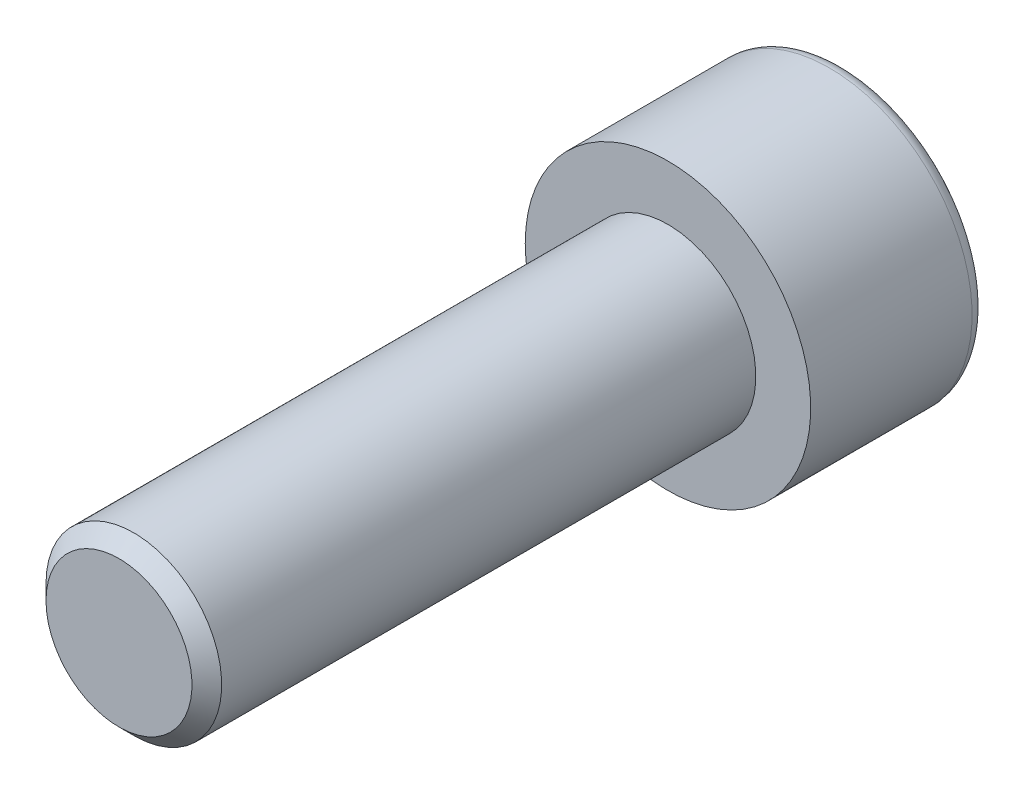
ISO-10303-21;
HEADER;
FILE_DESCRIPTION(('STEP AP214'),'2;1');
FILE_NAME('part.step','',(''),(''),'','','');
FILE_SCHEMA(('AUTOMOTIVE_DESIGN { 1 0 10303 214 1 1 1 1 }'));
ENDSEC;
DATA;
#1=APPLICATION_CONTEXT('core data for automotive mechanical design processes');
#2=APPLICATION_PROTOCOL_DEFINITION('international standard','automotive_design',2000,#1);
#3=PRODUCT_CONTEXT('',#1,'mechanical');
#4=PRODUCT('Part','Part','',(#3));
#5=PRODUCT_RELATED_PRODUCT_CATEGORY('part','',(#4));
#6=PRODUCT_DEFINITION_FORMATION('','',#4);
#7=PRODUCT_DEFINITION_CONTEXT('part definition',#1,'design');
#8=PRODUCT_DEFINITION('design','',#6,#7);
#9=PRODUCT_DEFINITION_SHAPE('','',#8);
#10=(LENGTH_UNIT() NAMED_UNIT(*) SI_UNIT(.MILLI.,.METRE.));
#11=(NAMED_UNIT(*) PLANE_ANGLE_UNIT() SI_UNIT($,.RADIAN.));
#12=(NAMED_UNIT(*) SI_UNIT($,.STERADIAN.) SOLID_ANGLE_UNIT());
#13=UNCERTAINTY_MEASURE_WITH_UNIT(LENGTH_MEASURE(1.E-05),#10,'distance_accuracy_value','');
#14=(GEOMETRIC_REPRESENTATION_CONTEXT(3) GLOBAL_UNCERTAINTY_ASSIGNED_CONTEXT((#13)) GLOBAL_UNIT_ASSIGNED_CONTEXT((#10,
#11,#12)) REPRESENTATION_CONTEXT('',''));
#15=CARTESIAN_POINT('',(0.,0.,0.));
#16=DIRECTION('',(0.,0.,1.));
#17=DIRECTION('',(1.,0.,0.));
#18=AXIS2_PLACEMENT_3D('',#15,#16,#17);
#19=CARTESIAN_POINT('',(0.,5.85,-8.));
#20=DIRECTION('',(0.,0.,1.));
#21=DIRECTION('',(1.,0.,0.));
#22=AXIS2_PLACEMENT_3D('',#19,#20,#21);
#23=PLANE('',#22);
#24=CARTESIAN_POINT('',(0.,0.,-8.));
#25=DIRECTION('',(0.,0.,-1.));
#26=DIRECTION('',(-1.,0.,0.));
#27=AXIS2_PLACEMENT_3D('',#24,#25,#26);
#28=CIRCLE('',#27,5.85);
#29=CARTESIAN_POINT('',(-5.85,0.,-8.));
#30=VERTEX_POINT('',#29);
#31=EDGE_CURVE('E106',#30,#30,#28,.T.);
#32=ORIENTED_EDGE('',*,*,#31,.T.);
#33=EDGE_LOOP('',(#32));
#34=FACE_BOUND('',#33,.T.);
#35=DIRECTION('',(-0.5,-0.866025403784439,0.));
#36=VECTOR('',#35,1.);
#37=CARTESIAN_POINT('',(-1.73205,2.99999860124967,-8.));
#38=LINE('',#37,#36);
#39=CARTESIAN_POINT('',(-1.73205,2.99999860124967,-8.));
#40=VERTEX_POINT('',#39);
#41=CARTESIAN_POINT('',(-3.4641,0.,-8.));
#42=VERTEX_POINT('',#41);
#43=EDGE_CURVE('E30',#40,#42,#38,.T.);
#44=ORIENTED_EDGE('',*,*,#43,.T.);
#45=DIRECTION('',(0.5,-0.866025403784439,0.));
#46=VECTOR('',#45,1.);
#47=CARTESIAN_POINT('',(-3.4641,0.,-8.));
#48=LINE('',#47,#46);
#49=CARTESIAN_POINT('',(-1.73205,-2.99999860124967,-8.));
#50=VERTEX_POINT('',#49);
#51=EDGE_CURVE('E166',#42,#50,#48,.T.);
#52=ORIENTED_EDGE('',*,*,#51,.T.);
#53=DIRECTION('',(1.,0.,0.));
#54=VECTOR('',#53,1.);
#55=CARTESIAN_POINT('',(-1.73205,-2.99999860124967,-8.));
#56=LINE('',#55,#54);
#57=CARTESIAN_POINT('',(1.73205,-2.99999860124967,-8.));
#58=VERTEX_POINT('',#57);
#59=EDGE_CURVE('E217',#50,#58,#56,.T.);
#60=ORIENTED_EDGE('',*,*,#59,.T.);
#61=DIRECTION('',(0.5,0.866025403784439,0.));
#62=VECTOR('',#61,1.);
#63=CARTESIAN_POINT('',(1.73205,-2.99999860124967,-8.));
#64=LINE('',#63,#62);
#65=CARTESIAN_POINT('',(3.4641,0.,-8.));
#66=VERTEX_POINT('',#65);
#67=EDGE_CURVE('E215',#58,#66,#64,.T.);
#68=ORIENTED_EDGE('',*,*,#67,.T.);
#69=DIRECTION('',(-0.5,0.866025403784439,0.));
#70=VECTOR('',#69,1.);
#71=CARTESIAN_POINT('',(3.4641,0.,-8.));
#72=LINE('',#71,#70);
#73=CARTESIAN_POINT('',(1.73205,2.99999860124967,-8.));
#74=VERTEX_POINT('',#73);
#75=EDGE_CURVE('E95',#66,#74,#72,.T.);
#76=ORIENTED_EDGE('',*,*,#75,.T.);
#77=DIRECTION('',(-1.,0.,0.));
#78=VECTOR('',#77,1.);
#79=CARTESIAN_POINT('',(1.73205,2.99999860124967,-8.));
#80=LINE('',#79,#78);
#81=EDGE_CURVE('E91',#74,#40,#80,.T.);
#82=ORIENTED_EDGE('',*,*,#81,.T.);
#83=EDGE_LOOP('',(#44,#52,#60,#68,#76,#82));
#84=FACE_BOUND('',#83,.T.);
#85=ADVANCED_FACE('F16',(#34,#84),#23,.F.);
#86=CARTESIAN_POINT('',(0.,0.,25.));
#87=DIRECTION('',(0.,0.,-1.));
#88=DIRECTION('',(-1.,0.,0.));
#89=AXIS2_PLACEMENT_3D('',#86,#87,#88);
#90=PLANE('',#89);
#91=CARTESIAN_POINT('',(0.,0.,25.));
#92=DIRECTION('',(0.,0.,-1.));
#93=DIRECTION('',(-1.,0.,0.));
#94=AXIS2_PLACEMENT_3D('',#91,#92,#93);
#95=CIRCLE('',#94,3.3234375);
#96=CARTESIAN_POINT('',(-3.32343750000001,0.,25.));
#97=VERTEX_POINT('',#96);
#98=EDGE_CURVE('E10',#97,#97,#95,.T.);
#99=ORIENTED_EDGE('',*,*,#98,.F.);
#100=EDGE_LOOP('',(#99));
#101=FACE_BOUND('',#100,.T.);
#102=ADVANCED_FACE('F125',(#101),#90,.F.);
#103=CARTESIAN_POINT('',(0.,0.,25.));
#104=DIRECTION('',(0.,0.,-1.));
#105=DIRECTION('',(-1.,0.,0.));
#106=AXIS2_PLACEMENT_3D('',#103,#104,#105);
#107=CONICAL_SURFACE('',#106,3.3234375,0.785398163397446);
#108=CARTESIAN_POINT('',(0.,0.,24.3234375));
#109=DIRECTION('',(0.,0.,-1.));
#110=DIRECTION('',(-1.,0.,0.));
#111=AXIS2_PLACEMENT_3D('',#108,#109,#110);
#112=CIRCLE('',#111,4.);
#113=CARTESIAN_POINT('',(-4.00000000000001,0.,24.3234375));
#114=VERTEX_POINT('',#113);
#115=EDGE_CURVE('E23',#114,#114,#112,.T.);
#116=ORIENTED_EDGE('',*,*,#115,.F.);
#117=EDGE_LOOP('',(#116));
#118=FACE_BOUND('',#117,.T.);
#119=ORIENTED_EDGE('',*,*,#98,.T.);
#120=EDGE_LOOP('',(#119));
#121=FACE_BOUND('',#120,.T.);
#122=ADVANCED_FACE('F122',(#118,#121),#107,.T.);
#123=CARTESIAN_POINT('',(0.,0.,-8.));
#124=DIRECTION('',(0.,0.,-1.));
#125=DIRECTION('',(-1.,0.,0.));
#126=AXIS2_PLACEMENT_3D('',#123,#124,#125);
#127=CYLINDRICAL_SURFACE('',#126,4.);
#128=CARTESIAN_POINT('',(0.,0.,0.));
#129=DIRECTION('',(0.,0.,-1.));
#130=DIRECTION('',(-1.,0.,0.));
#131=AXIS2_PLACEMENT_3D('',#128,#129,#130);
#132=CIRCLE('',#131,4.);
#133=CARTESIAN_POINT('',(-4.,0.,0.));
#134=VERTEX_POINT('',#133);
#135=EDGE_CURVE('E115',#134,#134,#132,.T.);
#136=ORIENTED_EDGE('',*,*,#135,.F.);
#137=EDGE_LOOP('',(#136));
#138=FACE_BOUND('',#137,.T.);
#139=ORIENTED_EDGE('',*,*,#115,.T.);
#140=EDGE_LOOP('',(#139));
#141=FACE_BOUND('',#140,.T.);
#142=ADVANCED_FACE('F120',(#138,#141),#127,.T.);
#143=CARTESIAN_POINT('',(0.,4.,0.));
#144=DIRECTION('',(0.,0.,-1.));
#145=DIRECTION('',(-1.,0.,0.));
#146=AXIS2_PLACEMENT_3D('',#143,#144,#145);
#147=PLANE('',#146);
#148=CARTESIAN_POINT('',(0.,0.,0.));
#149=DIRECTION('',(0.,0.,-1.));
#150=DIRECTION('',(-1.,0.,0.));
#151=AXIS2_PLACEMENT_3D('',#148,#149,#150);
#152=CIRCLE('',#151,6.5);
#153=CARTESIAN_POINT('',(-6.5,0.,0.));
#154=VERTEX_POINT('',#153);
#155=EDGE_CURVE('E112',#154,#154,#152,.T.);
#156=ORIENTED_EDGE('',*,*,#155,.F.);
#157=EDGE_LOOP('',(#156));
#158=FACE_BOUND('',#157,.T.);
#159=ORIENTED_EDGE('',*,*,#135,.T.);
#160=EDGE_LOOP('',(#159));
#161=FACE_BOUND('',#160,.T.);
#162=ADVANCED_FACE('F138',(#158,#161),#147,.F.);
#163=CARTESIAN_POINT('',(0.,0.,-8.));
#164=DIRECTION('',(0.,0.,-1.));
#165=DIRECTION('',(-1.,0.,0.));
#166=AXIS2_PLACEMENT_3D('',#163,#164,#165);
#167=CYLINDRICAL_SURFACE('',#166,6.5);
#168=CARTESIAN_POINT('',(0.,0.,-7.35));
#169=DIRECTION('',(0.,0.,-1.));
#170=DIRECTION('',(-1.,0.,0.));
#171=AXIS2_PLACEMENT_3D('',#168,#169,#170);
#172=CIRCLE('',#171,6.5);
#173=CARTESIAN_POINT('',(-6.5,0.,-7.35));
#174=VERTEX_POINT('',#173);
#175=EDGE_CURVE('E109',#174,#174,#172,.T.);
#176=ORIENTED_EDGE('',*,*,#175,.F.);
#177=EDGE_LOOP('',(#176));
#178=FACE_BOUND('',#177,.T.);
#179=ORIENTED_EDGE('',*,*,#155,.T.);
#180=EDGE_LOOP('',(#179));
#181=FACE_BOUND('',#180,.T.);
#182=ADVANCED_FACE('F142',(#178,#181),#167,.T.);
#183=CARTESIAN_POINT('',(0.,0.,-7.35));
#184=DIRECTION('',(0.,0.,-1.));
#185=DIRECTION('',(-1.,0.,0.));
#186=AXIS2_PLACEMENT_3D('',#183,#184,#185);
#187=TOROIDAL_SURFACE('',#186,5.85,0.65);
#188=ORIENTED_EDGE('',*,*,#31,.F.);
#189=EDGE_LOOP('',(#188));
#190=FACE_BOUND('',#189,.T.);
#191=ORIENTED_EDGE('',*,*,#175,.T.);
#192=EDGE_LOOP('',(#191));
#193=FACE_BOUND('',#192,.T.);
#194=ADVANCED_FACE('F146',(#190,#193),#187,.T.);
#195=CARTESIAN_POINT('',(-1.73205,2.99999860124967,-2.00000093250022));
#196=DIRECTION('',(0.866025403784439,-0.5,0.));
#197=DIRECTION('',(0.5,0.866025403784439,0.));
#198=AXIS2_PLACEMENT_3D('',#195,#196,#197);
#199=PLANE('',#198);
#200=DIRECTION('',(0.,0.,-1.));
#201=VECTOR('',#200,1.);
#202=CARTESIAN_POINT('',(-3.4641,0.,-2.00000093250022));
#203=LINE('',#202,#201);
#204=CARTESIAN_POINT('',(-3.4641,0.,-4.));
#205=VERTEX_POINT('',#204);
#206=EDGE_CURVE('E104',#205,#42,#203,.T.);
#207=ORIENTED_EDGE('',*,*,#206,.T.);
#208=ORIENTED_EDGE('',*,*,#43,.F.);
#209=DIRECTION('',(0.,0.,-1.));
#210=VECTOR('',#209,1.);
#211=CARTESIAN_POINT('',(-1.73205,2.99999860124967,-2.00000093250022));
#212=LINE('',#211,#210);
#213=CARTESIAN_POINT('',(-1.73205,2.99999860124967,-4.));
#214=VERTEX_POINT('',#213);
#215=EDGE_CURVE('E85',#214,#40,#212,.T.);
#216=ORIENTED_EDGE('',*,*,#215,.F.);
#217=CARTESIAN_POINT('',(-3.46410011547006,-2.E-07,-4.00000006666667));
#218=CARTESIAN_POINT('',(-3.38798700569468,0.131831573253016,-3.95604339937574));
#219=CARTESIAN_POINT('',(-3.31121688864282,0.264801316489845,-3.91606711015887));
#220=CARTESIAN_POINT('',(-3.15634743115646,0.533043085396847,-3.84628969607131));
#221=CARTESIAN_POINT('',(-3.07824533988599,0.668319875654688,-3.81651325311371));
#222=CARTESIAN_POINT('',(-2.92300903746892,0.937197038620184,-3.77016407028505));
#223=CARTESIAN_POINT('',(-2.84589870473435,1.070756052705,-3.75328281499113));
#224=CARTESIAN_POINT('',(-2.69131539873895,1.33850219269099,-3.73313388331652));
#225=CARTESIAN_POINT('',(-2.61384298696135,1.4726883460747,-3.72984951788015));
#226=CARTESIAN_POINT('',(-2.46909408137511,1.72340080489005,-3.7366995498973));
#227=CARTESIAN_POINT('',(-2.40179586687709,1.8399647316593,-3.74515203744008));
#228=CARTESIAN_POINT('',(-2.26763786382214,2.07233320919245,-3.77193605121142));
#229=CARTESIAN_POINT('',(-2.20077853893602,2.18813695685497,-3.79027671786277));
#230=CARTESIAN_POINT('',(-2.06634415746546,2.42098413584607,-3.83612483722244));
#231=CARTESIAN_POINT('',(-1.99878610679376,2.53799811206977,-3.86382654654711));
#232=CARTESIAN_POINT('',(-1.86467734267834,2.77028130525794,-3.92669771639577));
#233=CARTESIAN_POINT('',(-1.79812491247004,2.88555349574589,-3.96185241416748));
#234=CARTESIAN_POINT('',(-1.73204988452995,2.99999880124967,-4.00000006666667));
#235=B_SPLINE_CURVE_WITH_KNOTS('',3,(#217,#218,#219,#220,#221,#222,#223,#224,#225,#226,#227,
#228,#229,#230,#231,#232,#233,#234),.UNSPECIFIED.,.F.,.F.,(4,2,2,2,2,2,2,2,4),(0.,
0.475523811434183,0.952190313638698,1.4170607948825,1.8813605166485,2.2855607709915,
2.69013530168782,3.10368135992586,3.51641580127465),.UNSPECIFIED.);
#236=EDGE_CURVE('E78',#205,#214,#235,.T.);
#237=ORIENTED_EDGE('',*,*,#236,.F.);
#238=EDGE_LOOP('',(#207,#208,#216,#237));
#239=FACE_BOUND('',#238,.T.);
#240=ADVANCED_FACE('F86',(#239),#199,.T.);
#241=CARTESIAN_POINT('',(-3.4641,0.,-2.00000093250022));
#242=DIRECTION('',(0.866025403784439,0.5,0.));
#243=DIRECTION('',(-0.5,0.866025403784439,0.));
#244=AXIS2_PLACEMENT_3D('',#241,#242,#243);
#245=PLANE('',#244);
#246=DIRECTION('',(0.,0.,-1.));
#247=VECTOR('',#246,1.);
#248=CARTESIAN_POINT('',(-1.73205,-2.99999860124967,-2.00000093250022));
#249=LINE('',#248,#247);
#250=CARTESIAN_POINT('',(-1.73205,-2.99999860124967,-4.));
#251=VERTEX_POINT('',#250);
#252=EDGE_CURVE('E102',#251,#50,#249,.T.);
#253=ORIENTED_EDGE('',*,*,#252,.T.);
#254=ORIENTED_EDGE('',*,*,#51,.F.);
#255=ORIENTED_EDGE('',*,*,#206,.F.);
#256=CARTESIAN_POINT('',(-1.73204988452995,-2.99999880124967,-4.00000006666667));
#257=CARTESIAN_POINT('',(-1.80816299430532,-2.86816702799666,-3.95604339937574));
#258=CARTESIAN_POINT('',(-1.88493311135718,-2.73519728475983,-3.91606711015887));
#259=CARTESIAN_POINT('',(-2.03980256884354,-2.46695551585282,-3.84628969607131));
#260=CARTESIAN_POINT('',(-2.11790466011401,-2.33167872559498,-3.81651325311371));
#261=CARTESIAN_POINT('',(-2.27314096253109,-2.06280156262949,-3.77016407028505));
#262=CARTESIAN_POINT('',(-2.35025129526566,-1.92924254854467,-3.75328281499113));
#263=CARTESIAN_POINT('',(-2.50483460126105,-1.66149640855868,-3.73313388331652));
#264=CARTESIAN_POINT('',(-2.58230701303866,-1.52731025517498,-3.72984951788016));
#265=CARTESIAN_POINT('',(-2.72705591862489,-1.27659779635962,-3.73669954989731));
#266=CARTESIAN_POINT('',(-2.79435413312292,-1.16003386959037,-3.74515203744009));
#267=CARTESIAN_POINT('',(-2.92851213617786,-0.927665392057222,-3.77193605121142));
#268=CARTESIAN_POINT('',(-2.99537146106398,-0.811861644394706,-3.79027671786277));
#269=CARTESIAN_POINT('',(-3.12980584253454,-0.579014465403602,-3.83612483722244));
#270=CARTESIAN_POINT('',(-3.19736389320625,-0.4620004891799,-3.86382654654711));
#271=CARTESIAN_POINT('',(-3.33147265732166,-0.229717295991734,-3.92669771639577));
#272=CARTESIAN_POINT('',(-3.39802508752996,-0.114445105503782,-3.96185241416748));
#273=CARTESIAN_POINT('',(-3.46410011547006,2.00000000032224E-07,-4.00000006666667));
#274=B_SPLINE_CURVE_WITH_KNOTS('',3,(#256,#257,#258,#259,#260,#261,#262,#263,#264,#265,#266,
#267,#268,#269,#270,#271,#272,#273),.UNSPECIFIED.,.F.,.F.,(4,2,2,2,2,2,2,2,4),(0.,
0.475523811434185,0.9521903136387,1.4170607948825,1.8813605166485,2.28556077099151,
2.69013530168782,3.10368135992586,3.51641580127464),.UNSPECIFIED.);
#275=EDGE_CURVE('E82',#251,#205,#274,.T.);
#276=ORIENTED_EDGE('',*,*,#275,.F.);
#277=EDGE_LOOP('',(#253,#254,#255,#276));
#278=FACE_BOUND('',#277,.T.);
#279=ADVANCED_FACE('F154',(#278),#245,.T.);
#280=CARTESIAN_POINT('',(-1.73205,-2.99999860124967,-2.00000093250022));
#281=DIRECTION('',(0.,1.,0.));
#282=DIRECTION('',(-1.,0.,0.));
#283=AXIS2_PLACEMENT_3D('',#280,#281,#282);
#284=PLANE('',#283);
#285=DIRECTION('',(0.,0.,-1.));
#286=VECTOR('',#285,1.);
#287=CARTESIAN_POINT('',(1.73205,-2.99999860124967,-2.00000093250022));
#288=LINE('',#287,#286);
#289=CARTESIAN_POINT('',(1.73205,-2.99999860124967,-4.));
#290=VERTEX_POINT('',#289);
#291=EDGE_CURVE('E100',#290,#58,#288,.T.);
#292=ORIENTED_EDGE('',*,*,#291,.T.);
#293=ORIENTED_EDGE('',*,*,#59,.F.);
#294=ORIENTED_EDGE('',*,*,#252,.F.);
#295=CARTESIAN_POINT('',(4.48543327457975,-2.99999860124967,-5.11550534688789));
#296=CARTESIAN_POINT('',(4.35588300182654,-2.99999860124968,-5.05335202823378));
#297=CARTESIAN_POINT('',(4.22601712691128,-2.99999860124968,-4.99184428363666));
#298=CARTESIAN_POINT('',(3.96548596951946,-2.99999860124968,-4.87048616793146));
#299=CARTESIAN_POINT('',(3.83482054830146,-2.99999860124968,-4.81063609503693));
#300=CARTESIAN_POINT('',(3.57177288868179,-2.99999860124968,-4.69262519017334));
#301=CARTESIAN_POINT('',(3.43938504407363,-2.99999860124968,-4.63447680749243));
#302=CARTESIAN_POINT('',(3.17349843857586,-2.99999860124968,-4.52078755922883));
#303=CARTESIAN_POINT('',(3.03999973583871,-2.99999860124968,-4.46524655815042));
#304=CARTESIAN_POINT('',(2.76816246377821,-2.99999860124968,-4.35605208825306));
#305=CARTESIAN_POINT('',(2.62978861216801,-2.99999860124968,-4.30248593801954));
#306=CARTESIAN_POINT('',(2.35136718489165,-2.99999860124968,-4.19980717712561));
#307=CARTESIAN_POINT('',(2.21131941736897,-2.99999860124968,-4.15069508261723));
#308=CARTESIAN_POINT('',(1.92964461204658,-2.99999860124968,-4.05832683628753));
#309=CARTESIAN_POINT('',(1.78802198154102,-2.99999860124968,-4.01505738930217));
#310=CARTESIAN_POINT('',(1.50275951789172,-2.99999860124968,-3.93586037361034));
#311=CARTESIAN_POINT('',(1.35912038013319,-2.99999860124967,-3.89993033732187));
#312=CARTESIAN_POINT('',(1.07010555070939,-2.99999860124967,-3.83732117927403));
#313=CARTESIAN_POINT('',(0.92473396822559,-2.99999860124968,-3.81062345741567));
#314=CARTESIAN_POINT('',(0.6323644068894,-2.99999860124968,-3.76822932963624));
#315=CARTESIAN_POINT('',(0.485366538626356,-2.99999860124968,-3.75253218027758));
#316=CARTESIAN_POINT('',(0.192319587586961,-2.99999860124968,-3.73359558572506));
#317=CARTESIAN_POINT('',(0.0462802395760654,-2.99999860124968,-3.73020913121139));
#318=CARTESIAN_POINT('',(-0.245570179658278,-2.99999860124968,-3.73580306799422));
#319=CARTESIAN_POINT('',(-0.391381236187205,-2.99999860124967,-3.74478422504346));
#320=CARTESIAN_POINT('',(-0.643868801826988,-2.99999860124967,-3.77043931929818));
#321=CARTESIAN_POINT('',(-0.750824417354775,-2.99999860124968,-3.78449289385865));
#322=CARTESIAN_POINT('',(-0.963839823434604,-2.99999860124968,-3.81828752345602));
#323=CARTESIAN_POINT('',(-1.06989946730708,-2.99999860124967,-3.83802949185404));
#324=CARTESIAN_POINT('',(-1.38665231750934,-2.99999860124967,-3.90473774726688));
#325=CARTESIAN_POINT('',(-1.59578448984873,-2.99999860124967,-3.95917098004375));
#326=CARTESIAN_POINT('',(-1.90847464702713,-2.99999860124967,-4.05215904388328));
#327=CARTESIAN_POINT('',(-2.01368123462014,-2.99999860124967,-4.0854738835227));
#328=CARTESIAN_POINT('',(-2.22307127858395,-2.99999860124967,-4.15520553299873));
#329=CARTESIAN_POINT('',(-2.32725472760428,-2.99999860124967,-4.19162236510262));
#330=CARTESIAN_POINT('',(-2.53464013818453,-2.99999860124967,-4.26700365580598));
#331=CARTESIAN_POINT('',(-2.63784247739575,-2.99999860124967,-4.305967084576));
#332=CARTESIAN_POINT('',(-2.84341531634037,-2.99999860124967,-4.38601920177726));
#333=CARTESIAN_POINT('',(-2.94578582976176,-2.99999860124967,-4.42710785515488));
#334=CARTESIAN_POINT('',(-3.20709883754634,-2.99999860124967,-4.53462485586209));
#335=CARTESIAN_POINT('',(-3.36551841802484,-2.99999860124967,-4.60232247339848));
#336=CARTESIAN_POINT('',(-3.6809303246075,-2.99999860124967,-4.74097445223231));
#337=CARTESIAN_POINT('',(-3.83792254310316,-2.99999860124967,-4.81192905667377));
#338=CARTESIAN_POINT('',(-4.15078500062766,-2.99999860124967,-4.95636009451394));
#339=CARTESIAN_POINT('',(-4.30665496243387,-2.99999860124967,-5.02983712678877));
#340=CARTESIAN_POINT('',(-4.61745612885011,-2.99999860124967,-5.17875355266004));
#341=CARTESIAN_POINT('',(-4.77238731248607,-2.99999860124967,-5.25419298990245));
#342=CARTESIAN_POINT('',(-5.23640411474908,-2.99999860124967,-5.48299925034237));
#343=CARTESIAN_POINT('',(-5.54434651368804,-2.99999860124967,-5.63868230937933));
#344=CARTESIAN_POINT('',(-6.15811760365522,-2.99999860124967,-5.95402730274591));
#345=CARTESIAN_POINT('',(-6.46394659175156,-2.99999860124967,-6.11368866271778));
#346=CARTESIAN_POINT('',(-7.04534859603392,-2.99999860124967,-6.42057513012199));
#347=CARTESIAN_POINT('',(-7.32105297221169,-2.99999860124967,-6.56755177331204));
#348=CARTESIAN_POINT('',(-7.87157644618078,-2.99999860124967,-6.86317920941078));
#349=CARTESIAN_POINT('',(-8.14639550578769,-2.99999860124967,-7.01183007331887));
#350=CARTESIAN_POINT('',(-8.69465217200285,-2.99999860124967,-7.31000711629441));
#351=CARTESIAN_POINT('',(-8.96809151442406,-2.99999860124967,-7.4595301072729));
#352=CARTESIAN_POINT('',(-9.51441589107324,-2.99999860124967,-7.7595484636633));
#353=CARTESIAN_POINT('',(-9.78730095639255,-2.99999860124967,-7.91004377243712));
#354=CARTESIAN_POINT('',(-10.0599874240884,-2.99999860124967,-8.06089576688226));
#355=B_SPLINE_CURVE_WITH_KNOTS('',3,(#295,#296,#297,#298,#299,#300,#301,#302,#303,#304,#305,
#306,#307,#308,#309,#310,#311,#312,#313,#314,#315,#316,#317,#318,#319,#320,#321,#322,#323,#324,
#325,#326,#327,#328,#329,#330,#331,#332,#333,#334,#335,#336,#337,#338,#339,#340,#341,#342,#343,
#344,#345,#346,#347,#348,#349,#350,#351,#352,#353,#354),.UNSPECIFIED.,.F.,.F.,(4,2,2,2,2,2,2,2,
2,2,2,2,2,2,2,2,2,2,2,2,2,2,2,2,2,2,2,2,2,4),(0.,0.431070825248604,0.862218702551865,
1.29598193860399,1.72972260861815,2.1748037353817,2.61993637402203,3.06403838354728,
3.50799083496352,3.95104358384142,4.39406638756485,4.83178108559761,5.26952288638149,
5.5929878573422,5.91650479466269,6.56394435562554,6.89498708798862,7.2260321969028,
7.55694425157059,7.88785084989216,8.40463217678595,8.92145214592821,9.43839567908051,
9.95535071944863,10.9904746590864,12.0254500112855,12.962744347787,13.9000785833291,
14.8350286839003,15.7699248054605),.UNSPECIFIED.);
#356=EDGE_CURVE('E191',#290,#251,#355,.T.);
#357=ORIENTED_EDGE('',*,*,#356,.F.);
#358=EDGE_LOOP('',(#292,#293,#294,#357));
#359=FACE_BOUND('',#358,.T.);
#360=ADVANCED_FACE('F195',(#359),#284,.T.);
#361=CARTESIAN_POINT('',(1.73205,-2.99999860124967,-2.00000093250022));
#362=DIRECTION('',(-0.866025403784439,0.5,0.));
#363=DIRECTION('',(-0.5,-0.866025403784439,0.));
#364=AXIS2_PLACEMENT_3D('',#361,#362,#363);
#365=PLANE('',#364);
#366=DIRECTION('',(0.,0.,-1.));
#367=VECTOR('',#366,1.);
#368=CARTESIAN_POINT('',(3.4641,0.,-2.00000093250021));
#369=LINE('',#368,#367);
#370=CARTESIAN_POINT('',(3.4641,0.,-4.));
#371=VERTEX_POINT('',#370);
#372=EDGE_CURVE('E93',#371,#66,#369,.T.);
#373=ORIENTED_EDGE('',*,*,#372,.T.);
#374=ORIENTED_EDGE('',*,*,#67,.F.);
#375=ORIENTED_EDGE('',*,*,#291,.F.);
#376=CARTESIAN_POINT('',(3.46410011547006,1.99999999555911E-07,-4.00000006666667));
#377=CARTESIAN_POINT('',(3.38798700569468,-0.131831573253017,-3.95604339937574));
#378=CARTESIAN_POINT('',(3.31121688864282,-0.264801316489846,-3.91606711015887));
#379=CARTESIAN_POINT('',(3.15634743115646,-0.533043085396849,-3.84628969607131));
#380=CARTESIAN_POINT('',(3.07824533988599,-0.668319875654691,-3.81651325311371));
#381=CARTESIAN_POINT('',(2.92300903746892,-0.937197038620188,-3.77016407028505));
#382=CARTESIAN_POINT('',(2.84589870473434,-1.07075605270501,-3.75328281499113));
#383=CARTESIAN_POINT('',(2.69131539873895,-1.338502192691,-3.73313388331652));
#384=CARTESIAN_POINT('',(2.61384298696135,-1.4726883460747,-3.72984951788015));
#385=CARTESIAN_POINT('',(2.46909408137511,-1.72340080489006,-3.7366995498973));
#386=CARTESIAN_POINT('',(2.40179586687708,-1.83996473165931,-3.74515203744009));
#387=CARTESIAN_POINT('',(2.26763786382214,-2.07233320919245,-3.77193605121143));
#388=CARTESIAN_POINT('',(2.20077853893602,-2.18813695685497,-3.79027671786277));
#389=CARTESIAN_POINT('',(2.06634415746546,-2.42098413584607,-3.83612483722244));
#390=CARTESIAN_POINT('',(1.99878610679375,-2.53799811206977,-3.86382654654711));
#391=CARTESIAN_POINT('',(1.86467734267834,-2.77028130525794,-3.92669771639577));
#392=CARTESIAN_POINT('',(1.79812491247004,-2.88555349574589,-3.96185241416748));
#393=CARTESIAN_POINT('',(1.73204988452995,-2.99999880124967,-4.00000006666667));
#394=B_SPLINE_CURVE_WITH_KNOTS('',3,(#376,#377,#378,#379,#380,#381,#382,#383,#384,#385,#386,
#387,#388,#389,#390,#391,#392,#393),.UNSPECIFIED.,.F.,.F.,(4,2,2,2,2,2,2,2,4),(0.,
0.475523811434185,0.952190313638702,1.4170607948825,1.8813605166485,2.28556077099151,
2.69013530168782,3.10368135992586,3.51641580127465),.UNSPECIFIED.);
#395=EDGE_CURVE('E186',#371,#290,#394,.T.);
#396=ORIENTED_EDGE('',*,*,#395,.F.);
#397=EDGE_LOOP('',(#373,#374,#375,#396));
#398=FACE_BOUND('',#397,.T.);
#399=ADVANCED_FACE('F198',(#398),#365,.T.);
#400=CARTESIAN_POINT('',(3.4641,0.,-2.00000093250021));
#401=DIRECTION('',(-0.866025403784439,-0.5,0.));
#402=DIRECTION('',(0.5,-0.866025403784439,0.));
#403=AXIS2_PLACEMENT_3D('',#400,#401,#402);
#404=PLANE('',#403);
#405=DIRECTION('',(0.,0.,-1.));
#406=VECTOR('',#405,1.);
#407=CARTESIAN_POINT('',(1.73205,2.99999860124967,-2.00000093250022));
#408=LINE('',#407,#406);
#409=CARTESIAN_POINT('',(1.73205,2.99999860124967,-4.));
#410=VERTEX_POINT('',#409);
#411=EDGE_CURVE('E90',#410,#74,#408,.T.);
#412=ORIENTED_EDGE('',*,*,#411,.T.);
#413=ORIENTED_EDGE('',*,*,#75,.F.);
#414=ORIENTED_EDGE('',*,*,#372,.F.);
#415=CARTESIAN_POINT('',(1.73204988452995,2.99999880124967,-4.00000006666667));
#416=CARTESIAN_POINT('',(1.80816299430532,2.86816702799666,-3.95604339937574));
#417=CARTESIAN_POINT('',(1.88493311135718,2.73519728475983,-3.91606711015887));
#418=CARTESIAN_POINT('',(2.03980256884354,2.46695551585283,-3.84628969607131));
#419=CARTESIAN_POINT('',(2.11790466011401,2.33167872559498,-3.81651325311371));
#420=CARTESIAN_POINT('',(2.27314096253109,2.06280156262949,-3.77016407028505));
#421=CARTESIAN_POINT('',(2.35025129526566,1.92924254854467,-3.75328281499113));
#422=CARTESIAN_POINT('',(2.50483460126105,1.66149640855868,-3.73313388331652));
#423=CARTESIAN_POINT('',(2.58230701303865,1.52731025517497,-3.72984951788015));
#424=CARTESIAN_POINT('',(2.72705591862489,1.27659779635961,-3.7366995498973));
#425=CARTESIAN_POINT('',(2.79435413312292,1.16003386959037,-3.74515203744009));
#426=CARTESIAN_POINT('',(2.92851213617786,0.927665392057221,-3.77193605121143));
#427=CARTESIAN_POINT('',(2.99537146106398,0.811861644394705,-3.79027671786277));
#428=CARTESIAN_POINT('',(3.12980584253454,0.579014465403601,-3.83612483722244));
#429=CARTESIAN_POINT('',(3.19736389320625,0.462000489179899,-3.86382654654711));
#430=CARTESIAN_POINT('',(3.33147265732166,0.229717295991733,-3.92669771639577));
#431=CARTESIAN_POINT('',(3.39802508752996,0.114445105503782,-3.96185241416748));
#432=CARTESIAN_POINT('',(3.46410011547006,-2.00000000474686E-07,-4.00000006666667));
#433=B_SPLINE_CURVE_WITH_KNOTS('',3,(#415,#416,#417,#418,#419,#420,#421,#422,#423,#424,#425,
#426,#427,#428,#429,#430,#431,#432),.UNSPECIFIED.,.F.,.F.,(4,2,2,2,2,2,2,2,4),(0.,
0.475523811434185,0.952190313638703,1.41706079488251,1.8813605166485,2.28556077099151,
2.69013530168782,3.10368135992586,3.51641580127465),.UNSPECIFIED.);
#434=EDGE_CURVE('E38',#410,#371,#433,.T.);
#435=ORIENTED_EDGE('',*,*,#434,.F.);
#436=EDGE_LOOP('',(#412,#413,#414,#435));
#437=FACE_BOUND('',#436,.T.);
#438=ADVANCED_FACE('F202',(#437),#404,.T.);
#439=CARTESIAN_POINT('',(1.73205,2.99999860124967,-2.00000093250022));
#440=DIRECTION('',(0.,-1.,0.));
#441=DIRECTION('',(1.,0.,0.));
#442=AXIS2_PLACEMENT_3D('',#439,#440,#441);
#443=PLANE('',#442);
#444=ORIENTED_EDGE('',*,*,#215,.T.);
#445=ORIENTED_EDGE('',*,*,#81,.F.);
#446=ORIENTED_EDGE('',*,*,#411,.F.);
#447=CARTESIAN_POINT('',(4.48543327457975,2.99999860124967,-5.11550534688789));
#448=CARTESIAN_POINT('',(4.35588300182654,2.99999860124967,-5.05335202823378));
#449=CARTESIAN_POINT('',(4.22601712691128,2.99999860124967,-4.99184428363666));
#450=CARTESIAN_POINT('',(3.96548596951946,2.99999860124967,-4.87048616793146));
#451=CARTESIAN_POINT('',(3.83482054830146,2.99999860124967,-4.81063609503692));
#452=CARTESIAN_POINT('',(3.57177288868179,2.99999860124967,-4.69262519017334));
#453=CARTESIAN_POINT('',(3.43938504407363,2.99999860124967,-4.63447680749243));
#454=CARTESIAN_POINT('',(3.17349843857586,2.99999860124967,-4.52078755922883));
#455=CARTESIAN_POINT('',(3.03999973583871,2.99999860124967,-4.46524655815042));
#456=CARTESIAN_POINT('',(2.76816246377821,2.99999860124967,-4.35605208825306));
#457=CARTESIAN_POINT('',(2.62978861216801,2.99999860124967,-4.30248593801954));
#458=CARTESIAN_POINT('',(2.35136718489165,2.99999860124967,-4.19980717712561));
#459=CARTESIAN_POINT('',(2.21131941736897,2.99999860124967,-4.15069508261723));
#460=CARTESIAN_POINT('',(1.92964461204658,2.99999860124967,-4.05832683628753));
#461=CARTESIAN_POINT('',(1.78802198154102,2.99999860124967,-4.01505738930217));
#462=CARTESIAN_POINT('',(1.50275951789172,2.99999860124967,-3.93586037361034));
#463=CARTESIAN_POINT('',(1.35912038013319,2.99999860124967,-3.89993033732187));
#464=CARTESIAN_POINT('',(1.07010555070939,2.99999860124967,-3.83732117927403));
#465=CARTESIAN_POINT('',(0.924733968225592,2.99999860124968,-3.81062345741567));
#466=CARTESIAN_POINT('',(0.632364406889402,2.99999860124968,-3.76822932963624));
#467=CARTESIAN_POINT('',(0.485366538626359,2.99999860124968,-3.75253218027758));
#468=CARTESIAN_POINT('',(0.192319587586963,2.99999860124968,-3.73359558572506));
#469=CARTESIAN_POINT('',(0.0462802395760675,2.99999860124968,-3.73020913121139));
#470=CARTESIAN_POINT('',(-0.245570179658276,2.99999860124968,-3.73580306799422));
#471=CARTESIAN_POINT('',(-0.391381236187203,2.99999860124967,-3.74478422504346));
#472=CARTESIAN_POINT('',(-0.643868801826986,2.99999860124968,-3.77043931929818));
#473=CARTESIAN_POINT('',(-0.750824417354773,2.99999860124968,-3.78449289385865));
#474=CARTESIAN_POINT('',(-0.963839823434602,2.99999860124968,-3.81828752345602));
#475=CARTESIAN_POINT('',(-1.06989946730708,2.99999860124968,-3.83802949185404));
#476=CARTESIAN_POINT('',(-1.38665231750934,2.99999860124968,-3.90473774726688));
#477=CARTESIAN_POINT('',(-1.59578448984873,2.99999860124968,-3.95917098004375));
#478=CARTESIAN_POINT('',(-1.90847464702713,2.99999860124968,-4.05215904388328));
#479=CARTESIAN_POINT('',(-2.01368123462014,2.99999860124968,-4.0854738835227));
#480=CARTESIAN_POINT('',(-2.22307127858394,2.99999860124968,-4.15520553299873));
#481=CARTESIAN_POINT('',(-2.32725472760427,2.99999860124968,-4.19162236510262));
#482=CARTESIAN_POINT('',(-2.53464013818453,2.99999860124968,-4.26700365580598));
#483=CARTESIAN_POINT('',(-2.63784247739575,2.99999860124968,-4.305967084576));
#484=CARTESIAN_POINT('',(-2.84341531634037,2.99999860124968,-4.38601920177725));
#485=CARTESIAN_POINT('',(-2.94578582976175,2.99999860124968,-4.42710785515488));
#486=CARTESIAN_POINT('',(-3.20709883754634,2.99999860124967,-4.53462485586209));
#487=CARTESIAN_POINT('',(-3.36551841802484,2.99999860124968,-4.60232247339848));
#488=CARTESIAN_POINT('',(-3.6809303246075,2.99999860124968,-4.74097445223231));
#489=CARTESIAN_POINT('',(-3.83792254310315,2.99999860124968,-4.81192905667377));
#490=CARTESIAN_POINT('',(-4.15078500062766,2.99999860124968,-4.95636009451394));
#491=CARTESIAN_POINT('',(-4.30665496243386,2.99999860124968,-5.02983712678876));
#492=CARTESIAN_POINT('',(-4.6174561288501,2.99999860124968,-5.17875355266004));
#493=CARTESIAN_POINT('',(-4.77238731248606,2.99999860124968,-5.25419298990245));
#494=CARTESIAN_POINT('',(-5.23640411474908,2.99999860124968,-5.48299925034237));
#495=CARTESIAN_POINT('',(-5.54434651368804,2.99999860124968,-5.63868230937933));
#496=CARTESIAN_POINT('',(-6.15811760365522,2.99999860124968,-5.95402730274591));
#497=CARTESIAN_POINT('',(-6.46394659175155,2.99999860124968,-6.11368866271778));
#498=CARTESIAN_POINT('',(-7.04534859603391,2.99999860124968,-6.42057513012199));
#499=CARTESIAN_POINT('',(-7.32105297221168,2.99999860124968,-6.56755177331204));
#500=CARTESIAN_POINT('',(-7.87157644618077,2.99999860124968,-6.86317920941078));
#501=CARTESIAN_POINT('',(-8.14639550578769,2.99999860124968,-7.01183007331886));
#502=CARTESIAN_POINT('',(-8.69465217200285,2.99999860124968,-7.31000711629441));
#503=CARTESIAN_POINT('',(-8.96809151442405,2.99999860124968,-7.4595301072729));
#504=CARTESIAN_POINT('',(-9.51441589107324,2.99999860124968,-7.7595484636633));
#505=CARTESIAN_POINT('',(-9.78730095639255,2.99999860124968,-7.91004377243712));
#506=CARTESIAN_POINT('',(-10.0599874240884,2.99999860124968,-8.06089576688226));
#507=B_SPLINE_CURVE_WITH_KNOTS('',3,(#447,#448,#449,#450,#451,#452,#453,#454,#455,#456,#457,
#458,#459,#460,#461,#462,#463,#464,#465,#466,#467,#468,#469,#470,#471,#472,#473,#474,#475,#476,
#477,#478,#479,#480,#481,#482,#483,#484,#485,#486,#487,#488,#489,#490,#491,#492,#493,#494,#495,
#496,#497,#498,#499,#500,#501,#502,#503,#504,#505,#506),.UNSPECIFIED.,.F.,.F.,(4,2,2,2,2,2,2,2,
2,2,2,2,2,2,2,2,2,2,2,2,2,2,2,2,2,2,2,2,2,4),(0.,0.431070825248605,0.862218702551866,
1.29598193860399,1.72972260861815,2.1748037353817,2.61993637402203,3.06403838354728,
3.50799083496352,3.95104358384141,4.39406638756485,4.8317810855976,5.26952288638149,
5.5929878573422,5.91650479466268,6.56394435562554,6.89498708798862,7.22603219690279,
7.55694425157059,7.88785084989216,8.40463217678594,8.92145214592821,9.4383956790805,
9.95535071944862,10.9904746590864,12.0254500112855,12.962744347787,13.900078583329,
14.8350286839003,15.7699248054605),.UNSPECIFIED.);
#508=EDGE_CURVE('E79',#214,#410,#507,.F.);
#509=ORIENTED_EDGE('',*,*,#508,.F.);
#510=EDGE_LOOP('',(#444,#445,#446,#509));
#511=FACE_BOUND('',#510,.T.);
#512=ADVANCED_FACE('F74',(#511),#443,.T.);
#513=CARTESIAN_POINT('',(0.,0.,-2.00000093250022));
#514=DIRECTION('',(0.,0.,-1.));
#515=DIRECTION('',(-1.,0.,0.));
#516=AXIS2_PLACEMENT_3D('',#513,#514,#515);
#517=CONICAL_SURFACE('',#516,0.,1.0471975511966);
#518=CARTESIAN_POINT('',(0.,0.,-2.00000093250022));
#519=VERTEX_POINT('',#518);
#520=VERTEX_LOOP('',#519);
#521=FACE_BOUND('',#520,.T.);
#522=ORIENTED_EDGE('',*,*,#236,.T.);
#523=ORIENTED_EDGE('',*,*,#508,.T.);
#524=ORIENTED_EDGE('',*,*,#434,.T.);
#525=ORIENTED_EDGE('',*,*,#395,.T.);
#526=ORIENTED_EDGE('',*,*,#356,.T.);
#527=ORIENTED_EDGE('',*,*,#275,.T.);
#528=EDGE_LOOP('',(#522,#523,#524,#525,#526,#527));
#529=FACE_BOUND('',#528,.T.);
#530=ADVANCED_FACE('F71',(#521,#529),#517,.F.);
#531=CLOSED_SHELL('',(#85,#102,#122,#142,#162,#182,#194,#240,#279,#360,#399,#438,#512,#530));
#532=MANIFOLD_SOLID_BREP('B1',#531);
#533=ADVANCED_BREP_SHAPE_REPRESENTATION('',(#18,#532),#14);
#534=SHAPE_DEFINITION_REPRESENTATION(#9,#533);
ENDSEC;
END-ISO-10303-21;
